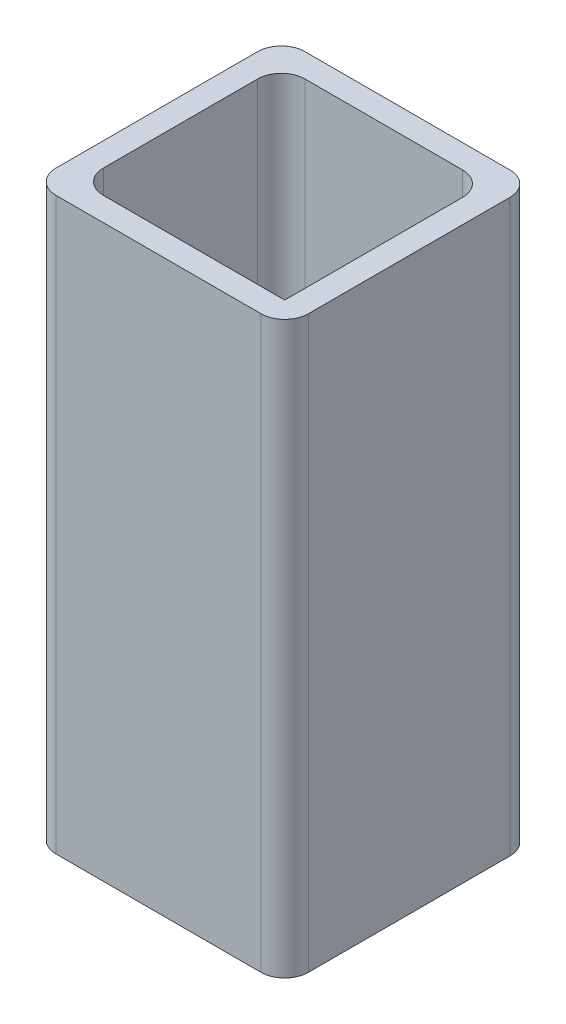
from build123d import *

# Parameters (mm, degrees)
CROQUIS1_W              = 106.616948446
CROQUIS1_H              = 105.193108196
CROQUIS1_W_2            = 86.616948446
CROQUIS1_H_2            = 85.193108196
SALIENTE_EXTRUIR1_DEPTH = 241
REDONDEO1_R             = 10


with BuildPart() as part:
    # Croquis1 → Saliente-Extruir1 (new body)
    with BuildSketch(Plane(origin=(0, 0, 0), x_dir=(1, 0, 0), z_dir=(0, 1, 0))):
        Rectangle(CROQUIS1_W, CROQUIS1_H)
        Rectangle(CROQUIS1_W_2, CROQUIS1_H_2, mode=Mode.SUBTRACT)
    extrude(amount=SALIENTE_EXTRUIR1_DEPTH)

    # Redondeo1
    redondeo1_edges = [part.edges().sort_by_distance(p)[0] for p in [
        (-43.308474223, 120.5, -42.596554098),
        (-43.308474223, 120.5, 42.596554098),
        (43.308474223, 120.5, -42.596554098),
        (-53.308474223, 120.5, -52.596554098),
        (53.308474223, 120.5, -52.596554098),
        (53.308474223, 120.5, 52.596554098),
        (-53.308474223, 120.5, 52.596554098),
    ]]
    fillet(redondeo1_edges, radius=REDONDEO1_R)


solid = part.part
